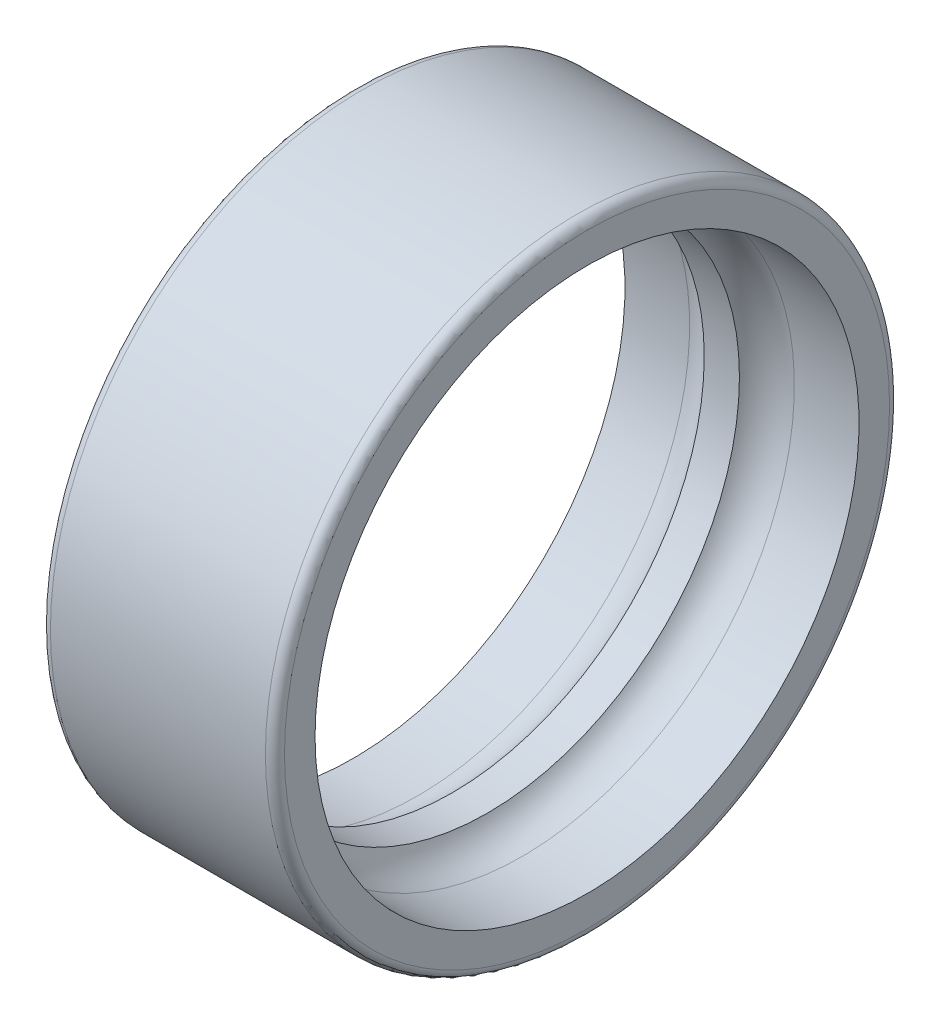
from build123d import *


with BuildPart() as part:
    # Esquisse1 → R_volution1 (revolve)
    with BuildSketch(Plane.XY, mode=Mode.PRIVATE) as r_volution1_sk:
        with BuildLine():
            Line((-12.4, 36), (12.4, 36))
            ThreePointArc((12.4, 36), (13.177817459, 35.677817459), (13.5, 34.9))
            Line((13.5, 34.9), (13.5, 31.375))
            Line((13.5, 31.375), (6.041666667, 31.375))
            ThreePointArc((6.041666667, 31.375), (3.72292509, 30.751757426), (2.029108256, 29.05))
            Line((2.029108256, 29.05), (-2.029108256, 29.05))
            ThreePointArc((-2.029108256, 29.05), (-3.72292509, 30.751757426), (-6.041666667, 31.375))
            Line((-6.041666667, 31.375), (-13.5, 31.375))
            Line((-13.5, 31.375), (-13.5, 34.9))
            ThreePointArc((-13.5, 34.9), (-13.177817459, 35.677817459), (-12.4, 36))
        make_face()
    revolve(r_volution1_sk.sketch.rotate(Axis((0, 0, 0), (1, 0, 0)), 90), axis=Axis((0, 0, 0), (1, 0, 0)))


solid = part.part
